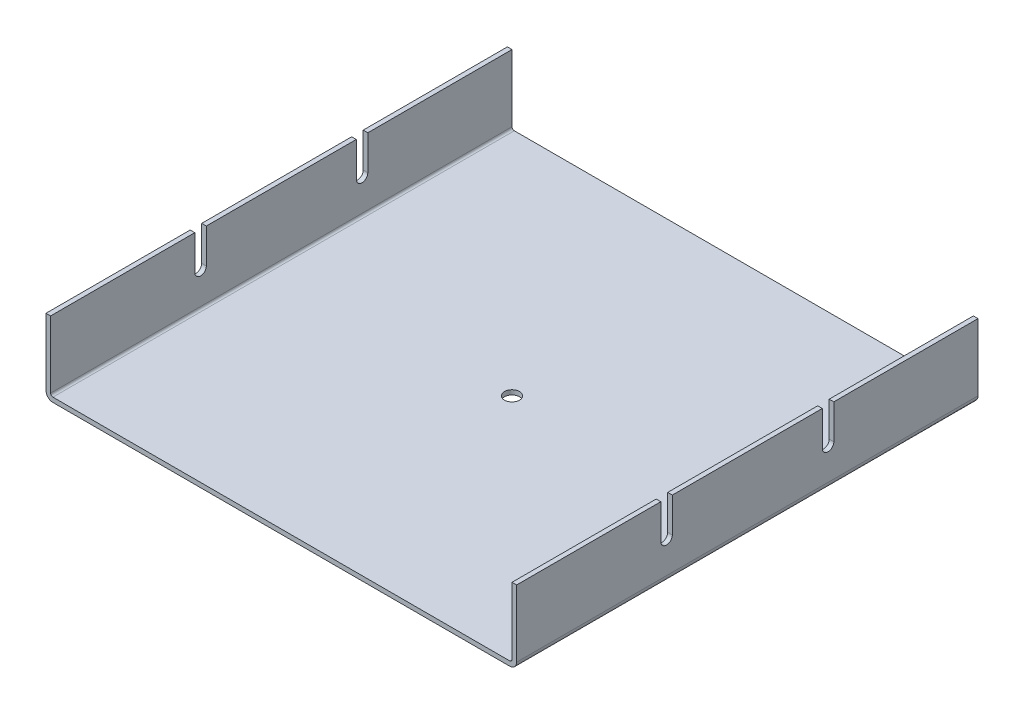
from build123d import *

# Parameters (mm, degrees)
EXTRUSION1_DEPTH        = 100
ESQUISSE2_R             = 3.25
ENL_V_MAT_EXTRU_1_DEPTH = 147.383059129
ENL_V_MAT_EXTRU_2_DEPTH = 230.16369695


with BuildPart() as part:
    # Esquisse1 → Extrusion1 (new, symmetric)
    with BuildSketch(Plane.XY):
        with BuildLine():
            Line((102, 1), (102, 30))
            Line((102, 30), (100, 30))
            Line((100, 30), (100, 1))
            ThreePointArc((100, 1), (99.707106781, 0.292893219), (99, 0))
            Line((99, 0), (-99, 0))
            ThreePointArc((-99, 0), (-99.707106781, 0.292893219), (-100, 1))
            Line((-100, 1), (-100, 30))
            Line((-100, 30), (-102, 30))
            Line((-102, 30), (-102, 1))
            ThreePointArc((-102, 1), (-101.121320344, -1.121320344), (-99, -2))
            Line((-99, -2), (99, -2))
            ThreePointArc((99, -2), (101.121320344, -1.121320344), (102, 1))
        make_face()
    extrude(amount=EXTRUSION1_DEPTH, both=True)

    # Esquisse2 → Enl_v. mat.-Extru.1 (cut, through all)
    with BuildSketch(Plane.XZ.offset(2)):
        with Locations(Location((0, 0, 0), (0, 0, 270))):
            Circle(ESQUISSE2_R)
    extrude(amount=-ENL_V_MAT_EXTRU_1_DEPTH, mode=Mode.SUBTRACT)

    # Esquisse3 → Enl_v. mat.-Extru.2 (cut, through all)
    with BuildSketch(Plane.ZY.offset(102)):
        with BuildLine():
            Line((-37.5, 30), (-32.5, 30))
            Line((-32.5, 30), (-32.5, 15))
            ThreePointArc((-32.5, 15), (-35, 12.5), (-37.5, 15))
            Line((-37.5, 15), (-37.5, 30))
        make_face()
        with BuildLine():
            Line((32.5, 30), (32.5, 15))
            ThreePointArc((32.5, 15), (35, 12.5), (37.5, 15))
            Line((37.5, 15), (37.5, 30))
            Line((37.5, 30), (32.5, 30))
        make_face()
    extrude(amount=-ENL_V_MAT_EXTRU_2_DEPTH, mode=Mode.SUBTRACT)


solid = part.part
